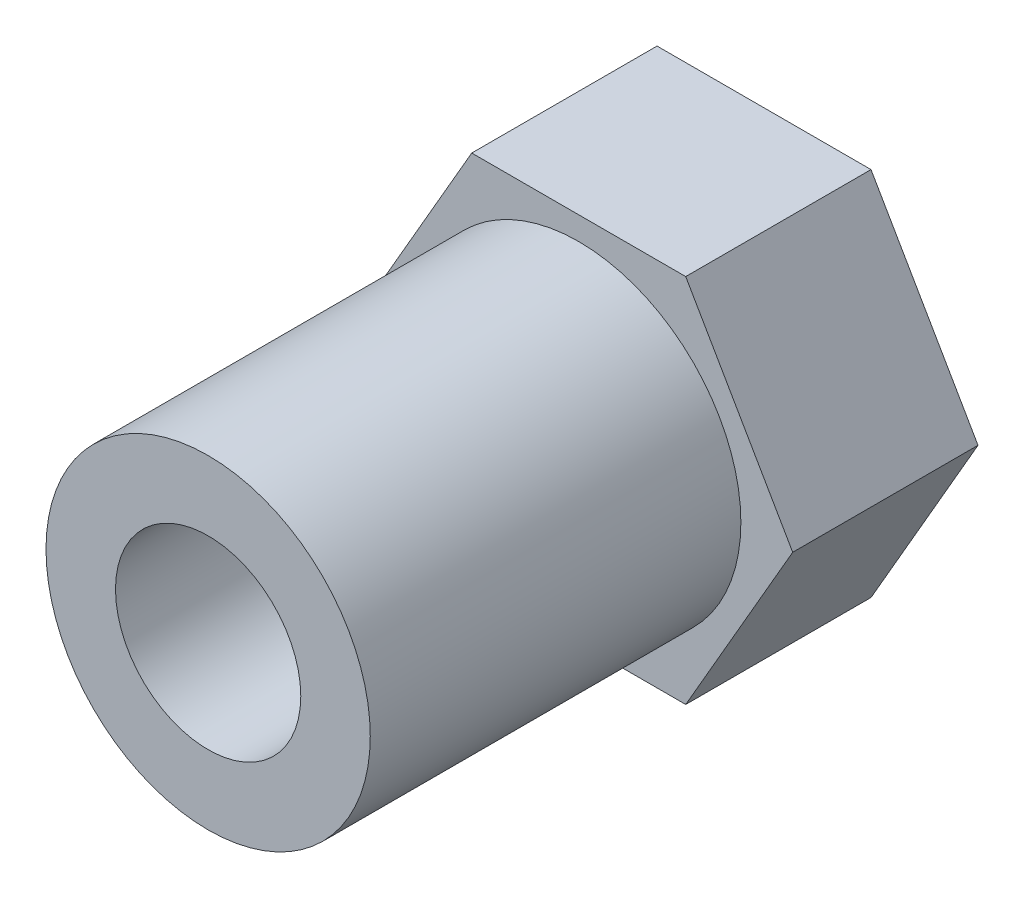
ISO-10303-21;
HEADER;
FILE_DESCRIPTION(('STEP AP214'),'2;1');
FILE_NAME('part.step','',(''),(''),'','','');
FILE_SCHEMA(('AUTOMOTIVE_DESIGN { 1 0 10303 214 1 1 1 1 }'));
ENDSEC;
DATA;
#1=APPLICATION_CONTEXT('core data for automotive mechanical design processes');
#2=APPLICATION_PROTOCOL_DEFINITION('international standard','automotive_design',2000,#1);
#3=PRODUCT_CONTEXT('',#1,'mechanical');
#4=PRODUCT('Part','Part','',(#3));
#5=PRODUCT_RELATED_PRODUCT_CATEGORY('part','',(#4));
#6=PRODUCT_DEFINITION_FORMATION('','',#4);
#7=PRODUCT_DEFINITION_CONTEXT('part definition',#1,'design');
#8=PRODUCT_DEFINITION('design','',#6,#7);
#9=PRODUCT_DEFINITION_SHAPE('','',#8);
#10=(LENGTH_UNIT() NAMED_UNIT(*) SI_UNIT(.MILLI.,.METRE.));
#11=(NAMED_UNIT(*) PLANE_ANGLE_UNIT() SI_UNIT($,.RADIAN.));
#12=(NAMED_UNIT(*) SI_UNIT($,.STERADIAN.) SOLID_ANGLE_UNIT());
#13=UNCERTAINTY_MEASURE_WITH_UNIT(LENGTH_MEASURE(1.E-05),#10,'distance_accuracy_value','');
#14=(GEOMETRIC_REPRESENTATION_CONTEXT(3) GLOBAL_UNCERTAINTY_ASSIGNED_CONTEXT((#13)) GLOBAL_UNIT_ASSIGNED_CONTEXT((#10,
#11,#12)) REPRESENTATION_CONTEXT('',''));
#15=CARTESIAN_POINT('',(0.,0.,0.));
#16=DIRECTION('',(0.,0.,1.));
#17=DIRECTION('',(1.,0.,0.));
#18=AXIS2_PLACEMENT_3D('',#15,#16,#17);
#19=CARTESIAN_POINT('',(3.46410161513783,-5.99999999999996,6.));
#20=DIRECTION('',(-0.866025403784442,0.499999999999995,0.));
#21=DIRECTION('',(-0.499999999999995,-0.866025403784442,0.));
#22=AXIS2_PLACEMENT_3D('',#19,#20,#21);
#23=PLANE('',#22);
#24=DIRECTION('',(0.499999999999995,0.866025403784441,0.));
#25=VECTOR('',#24,1.);
#26=CARTESIAN_POINT('',(3.46410161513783,-5.99999999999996,0.));
#27=LINE('',#26,#25);
#28=CARTESIAN_POINT('',(3.46410161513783,-5.99999999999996,0.));
#29=VERTEX_POINT('',#28);
#30=CARTESIAN_POINT('',(6.92820323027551,0.,0.));
#31=VERTEX_POINT('',#30);
#32=EDGE_CURVE('E121',#29,#31,#27,.T.);
#33=ORIENTED_EDGE('',*,*,#32,.T.);
#34=DIRECTION('',(0.,0.,-1.));
#35=VECTOR('',#34,1.);
#36=CARTESIAN_POINT('',(6.92820323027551,0.,6.));
#37=LINE('',#36,#35);
#38=CARTESIAN_POINT('',(6.92820323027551,0.,6.));
#39=VERTEX_POINT('',#38);
#40=EDGE_CURVE('E11',#39,#31,#37,.T.);
#41=ORIENTED_EDGE('',*,*,#40,.F.);
#42=DIRECTION('',(0.499999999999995,0.866025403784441,0.));
#43=VECTOR('',#42,1.);
#44=CARTESIAN_POINT('',(3.46410161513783,-5.99999999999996,6.));
#45=LINE('',#44,#43);
#46=CARTESIAN_POINT('',(3.46410161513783,-5.99999999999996,6.));
#47=VERTEX_POINT('',#46);
#48=EDGE_CURVE('E132',#47,#39,#45,.T.);
#49=ORIENTED_EDGE('',*,*,#48,.F.);
#50=DIRECTION('',(0.,0.,-1.));
#51=VECTOR('',#50,1.);
#52=CARTESIAN_POINT('',(3.46410161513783,-5.99999999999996,6.));
#53=LINE('',#52,#51);
#54=EDGE_CURVE('E117',#47,#29,#53,.T.);
#55=ORIENTED_EDGE('',*,*,#54,.T.);
#56=EDGE_LOOP('',(#33,#41,#49,#55));
#57=FACE_BOUND('',#56,.T.);
#58=ADVANCED_FACE('F37',(#57),#23,.F.);
#59=CARTESIAN_POINT('',(6.92820323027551,0.,6.));
#60=DIRECTION('',(-0.866025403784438,-0.500000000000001,0.));
#61=DIRECTION('',(0.500000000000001,-0.866025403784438,0.));
#62=AXIS2_PLACEMENT_3D('',#59,#60,#61);
#63=PLANE('',#62);
#64=DIRECTION('',(-0.500000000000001,0.866025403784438,0.));
#65=VECTOR('',#64,1.);
#66=CARTESIAN_POINT('',(6.92820323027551,0.,0.));
#67=LINE('',#66,#65);
#68=CARTESIAN_POINT('',(3.46410161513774,6.00000000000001,0.));
#69=VERTEX_POINT('',#68);
#70=EDGE_CURVE('E124',#31,#69,#67,.T.);
#71=ORIENTED_EDGE('',*,*,#70,.T.);
#72=DIRECTION('',(0.,0.,-1.));
#73=VECTOR('',#72,1.);
#74=CARTESIAN_POINT('',(3.46410161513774,6.00000000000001,6.));
#75=LINE('',#74,#73);
#76=CARTESIAN_POINT('',(3.46410161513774,6.00000000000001,6.));
#77=VERTEX_POINT('',#76);
#78=EDGE_CURVE('E45',#77,#69,#75,.T.);
#79=ORIENTED_EDGE('',*,*,#78,.F.);
#80=DIRECTION('',(-0.500000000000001,0.866025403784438,0.));
#81=VECTOR('',#80,1.);
#82=CARTESIAN_POINT('',(6.92820323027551,0.,6.));
#83=LINE('',#82,#81);
#84=EDGE_CURVE('E90',#39,#77,#83,.T.);
#85=ORIENTED_EDGE('',*,*,#84,.F.);
#86=ORIENTED_EDGE('',*,*,#40,.T.);
#87=EDGE_LOOP('',(#71,#79,#85,#86));
#88=FACE_BOUND('',#87,.T.);
#89=ADVANCED_FACE('F157',(#88),#63,.F.);
#90=CARTESIAN_POINT('',(3.46410161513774,6.00000000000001,6.));
#91=DIRECTION('',(0.,-1.,0.));
#92=DIRECTION('',(1.,0.,0.));
#93=AXIS2_PLACEMENT_3D('',#90,#91,#92);
#94=PLANE('',#93);
#95=DIRECTION('',(-1.,0.,0.));
#96=VECTOR('',#95,1.);
#97=CARTESIAN_POINT('',(3.46410161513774,6.00000000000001,0.));
#98=LINE('',#97,#96);
#99=CARTESIAN_POINT('',(-3.46410161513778,5.99999999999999,0.));
#100=VERTEX_POINT('',#99);
#101=EDGE_CURVE('E127',#69,#100,#98,.T.);
#102=ORIENTED_EDGE('',*,*,#101,.T.);
#103=DIRECTION('',(0.,0.,-1.));
#104=VECTOR('',#103,1.);
#105=CARTESIAN_POINT('',(-3.46410161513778,5.99999999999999,6.));
#106=LINE('',#105,#104);
#107=CARTESIAN_POINT('',(-3.46410161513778,5.99999999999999,6.));
#108=VERTEX_POINT('',#107);
#109=EDGE_CURVE('E112',#108,#100,#106,.T.);
#110=ORIENTED_EDGE('',*,*,#109,.F.);
#111=DIRECTION('',(-1.,0.,0.));
#112=VECTOR('',#111,1.);
#113=CARTESIAN_POINT('',(3.46410161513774,6.00000000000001,6.));
#114=LINE('',#113,#112);
#115=EDGE_CURVE('E103',#77,#108,#114,.T.);
#116=ORIENTED_EDGE('',*,*,#115,.F.);
#117=ORIENTED_EDGE('',*,*,#78,.T.);
#118=EDGE_LOOP('',(#102,#110,#116,#117));
#119=FACE_BOUND('',#118,.T.);
#120=ADVANCED_FACE('F138',(#119),#94,.F.);
#121=CARTESIAN_POINT('',(-3.46410161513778,5.99999999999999,6.));
#122=DIRECTION('',(0.866025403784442,-0.499999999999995,0.));
#123=DIRECTION('',(0.499999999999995,0.866025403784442,0.));
#124=AXIS2_PLACEMENT_3D('',#121,#122,#123);
#125=PLANE('',#124);
#126=DIRECTION('',(-0.499999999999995,-0.866025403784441,0.));
#127=VECTOR('',#126,1.);
#128=CARTESIAN_POINT('',(-3.46410161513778,5.99999999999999,0.));
#129=LINE('',#128,#127);
#130=CARTESIAN_POINT('',(-6.92820323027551,0.,0.));
#131=VERTEX_POINT('',#130);
#132=EDGE_CURVE('E111',#100,#131,#129,.T.);
#133=ORIENTED_EDGE('',*,*,#132,.T.);
#134=DIRECTION('',(0.,0.,-1.));
#135=VECTOR('',#134,1.);
#136=CARTESIAN_POINT('',(-6.92820323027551,0.,6.));
#137=LINE('',#136,#135);
#138=CARTESIAN_POINT('',(-6.92820323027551,0.,6.));
#139=VERTEX_POINT('',#138);
#140=EDGE_CURVE('E108',#139,#131,#137,.T.);
#141=ORIENTED_EDGE('',*,*,#140,.F.);
#142=DIRECTION('',(-0.499999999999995,-0.866025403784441,0.));
#143=VECTOR('',#142,1.);
#144=CARTESIAN_POINT('',(-3.46410161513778,5.99999999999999,6.));
#145=LINE('',#144,#143);
#146=EDGE_CURVE('E97',#108,#139,#145,.T.);
#147=ORIENTED_EDGE('',*,*,#146,.F.);
#148=ORIENTED_EDGE('',*,*,#109,.T.);
#149=EDGE_LOOP('',(#133,#141,#147,#148));
#150=FACE_BOUND('',#149,.T.);
#151=ADVANCED_FACE('F109',(#150),#125,.F.);
#152=CARTESIAN_POINT('',(-6.92820323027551,0.,6.));
#153=DIRECTION('',(0.866025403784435,0.500000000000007,0.));
#154=DIRECTION('',(-0.500000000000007,0.866025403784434,0.));
#155=AXIS2_PLACEMENT_3D('',#152,#153,#154);
#156=PLANE('',#155);
#157=DIRECTION('',(0.500000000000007,-0.866025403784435,0.));
#158=VECTOR('',#157,1.);
#159=CARTESIAN_POINT('',(-6.92820323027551,0.,0.));
#160=LINE('',#159,#158);
#161=CARTESIAN_POINT('',(-3.4641016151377,-6.00000000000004,0.));
#162=VERTEX_POINT('',#161);
#163=EDGE_CURVE('E76',#131,#162,#160,.T.);
#164=ORIENTED_EDGE('',*,*,#163,.T.);
#165=DIRECTION('',(0.,0.,-1.));
#166=VECTOR('',#165,1.);
#167=CARTESIAN_POINT('',(-3.4641016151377,-6.00000000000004,6.));
#168=LINE('',#167,#166);
#169=CARTESIAN_POINT('',(-3.4641016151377,-6.00000000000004,6.));
#170=VERTEX_POINT('',#169);
#171=EDGE_CURVE('E113',#170,#162,#168,.T.);
#172=ORIENTED_EDGE('',*,*,#171,.F.);
#173=DIRECTION('',(0.500000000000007,-0.866025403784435,0.));
#174=VECTOR('',#173,1.);
#175=CARTESIAN_POINT('',(-6.92820323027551,0.,6.));
#176=LINE('',#175,#174);
#177=EDGE_CURVE('E101',#139,#170,#176,.T.);
#178=ORIENTED_EDGE('',*,*,#177,.F.);
#179=ORIENTED_EDGE('',*,*,#140,.T.);
#180=EDGE_LOOP('',(#164,#172,#178,#179));
#181=FACE_BOUND('',#180,.T.);
#182=ADVANCED_FACE('F115',(#181),#156,.F.);
#183=CARTESIAN_POINT('',(-3.4641016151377,-6.00000000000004,6.));
#184=DIRECTION('',(0.,1.,0.));
#185=DIRECTION('',(-1.,0.,0.));
#186=AXIS2_PLACEMENT_3D('',#183,#184,#185);
#187=PLANE('',#186);
#188=DIRECTION('',(1.,0.,0.));
#189=VECTOR('',#188,1.);
#190=CARTESIAN_POINT('',(-3.4641016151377,-6.00000000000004,0.));
#191=LINE('',#190,#189);
#192=EDGE_CURVE('E82',#162,#29,#191,.T.);
#193=ORIENTED_EDGE('',*,*,#192,.T.);
#194=ORIENTED_EDGE('',*,*,#54,.F.);
#195=DIRECTION('',(1.,0.,0.));
#196=VECTOR('',#195,1.);
#197=CARTESIAN_POINT('',(-3.4641016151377,-6.00000000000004,6.));
#198=LINE('',#197,#196);
#199=EDGE_CURVE('E53',#170,#47,#198,.T.);
#200=ORIENTED_EDGE('',*,*,#199,.F.);
#201=ORIENTED_EDGE('',*,*,#171,.T.);
#202=EDGE_LOOP('',(#193,#194,#200,#201));
#203=FACE_BOUND('',#202,.T.);
#204=ADVANCED_FACE('F145',(#203),#187,.F.);
#205=CARTESIAN_POINT('',(0.,0.,6.));
#206=DIRECTION('',(0.,0.,1.));
#207=DIRECTION('',(1.,0.,0.));
#208=AXIS2_PLACEMENT_3D('',#205,#206,#207);
#209=PLANE('',#208);
#210=CARTESIAN_POINT('',(0.,0.,6.));
#211=DIRECTION('',(0.,0.,1.));
#212=DIRECTION('',(1.,0.,0.));
#213=AXIS2_PLACEMENT_3D('',#210,#211,#212);
#214=CIRCLE('',#213,5.25);
#215=CARTESIAN_POINT('',(5.25,0.,6.));
#216=VERTEX_POINT('',#215);
#217=EDGE_CURVE('E262',#216,#216,#214,.T.);
#218=ORIENTED_EDGE('',*,*,#217,.F.);
#219=EDGE_LOOP('',(#218));
#220=FACE_BOUND('',#219,.T.);
#221=ORIENTED_EDGE('',*,*,#48,.T.);
#222=ORIENTED_EDGE('',*,*,#84,.T.);
#223=ORIENTED_EDGE('',*,*,#115,.T.);
#224=ORIENTED_EDGE('',*,*,#146,.T.);
#225=ORIENTED_EDGE('',*,*,#177,.T.);
#226=ORIENTED_EDGE('',*,*,#199,.T.);
#227=EDGE_LOOP('',(#221,#222,#223,#224,#225,#226));
#228=FACE_BOUND('',#227,.T.);
#229=ADVANCED_FACE('F99',(#220,#228),#209,.T.);
#230=CARTESIAN_POINT('',(0.,0.,0.));
#231=DIRECTION('',(0.,0.,1.));
#232=DIRECTION('',(1.,0.,0.));
#233=AXIS2_PLACEMENT_3D('',#230,#231,#232);
#234=PLANE('',#233);
#235=CARTESIAN_POINT('',(0.,0.,0.));
#236=DIRECTION('',(0.,0.,1.));
#237=DIRECTION('',(1.,0.,0.));
#238=AXIS2_PLACEMENT_3D('',#235,#236,#237);
#239=CIRCLE('',#238,2.);
#240=CARTESIAN_POINT('',(2.,0.,0.));
#241=VERTEX_POINT('',#240);
#242=EDGE_CURVE('E253',#241,#241,#239,.T.);
#243=ORIENTED_EDGE('',*,*,#242,.T.);
#244=EDGE_LOOP('',(#243));
#245=FACE_BOUND('',#244,.T.);
#246=ORIENTED_EDGE('',*,*,#32,.F.);
#247=ORIENTED_EDGE('',*,*,#192,.F.);
#248=ORIENTED_EDGE('',*,*,#163,.F.);
#249=ORIENTED_EDGE('',*,*,#132,.F.);
#250=ORIENTED_EDGE('',*,*,#101,.F.);
#251=ORIENTED_EDGE('',*,*,#70,.F.);
#252=EDGE_LOOP('',(#246,#247,#248,#249,#250,#251));
#253=FACE_BOUND('',#252,.T.);
#254=ADVANCED_FACE('F141',(#245,#253),#234,.F.);
#255=CARTESIAN_POINT('',(0.,0.,18.));
#256=DIRECTION('',(0.,0.,-1.));
#257=DIRECTION('',(-1.,0.,0.));
#258=AXIS2_PLACEMENT_3D('',#255,#256,#257);
#259=CYLINDRICAL_SURFACE('',#258,5.25);
#260=CARTESIAN_POINT('',(0.,0.,18.));
#261=DIRECTION('',(0.,0.,1.));
#262=DIRECTION('',(1.,0.,0.));
#263=AXIS2_PLACEMENT_3D('',#260,#261,#262);
#264=CIRCLE('',#263,5.25);
#265=CARTESIAN_POINT('',(5.25,0.,18.));
#266=VERTEX_POINT('',#265);
#267=EDGE_CURVE('E125',#266,#266,#264,.T.);
#268=ORIENTED_EDGE('',*,*,#267,.F.);
#269=EDGE_LOOP('',(#268));
#270=FACE_BOUND('',#269,.T.);
#271=ORIENTED_EDGE('',*,*,#217,.T.);
#272=EDGE_LOOP('',(#271));
#273=FACE_BOUND('',#272,.T.);
#274=ADVANCED_FACE('F192',(#270,#273),#259,.T.);
#275=CARTESIAN_POINT('',(0.,0.,18.));
#276=DIRECTION('',(0.,0.,1.));
#277=DIRECTION('',(1.,0.,0.));
#278=AXIS2_PLACEMENT_3D('',#275,#276,#277);
#279=PLANE('',#278);
#280=CARTESIAN_POINT('',(0.,0.,18.));
#281=DIRECTION('',(0.,0.,1.));
#282=DIRECTION('',(1.,0.,0.));
#283=AXIS2_PLACEMENT_3D('',#280,#281,#282);
#284=CIRCLE('',#283,3.);
#285=CARTESIAN_POINT('',(3.,0.,18.));
#286=VERTEX_POINT('',#285);
#287=EDGE_CURVE('E254',#286,#286,#284,.T.);
#288=ORIENTED_EDGE('',*,*,#287,.F.);
#289=EDGE_LOOP('',(#288));
#290=FACE_BOUND('',#289,.T.);
#291=ORIENTED_EDGE('',*,*,#267,.T.);
#292=EDGE_LOOP('',(#291));
#293=FACE_BOUND('',#292,.T.);
#294=ADVANCED_FACE('F197',(#290,#293),#279,.T.);
#295=CARTESIAN_POINT('',(0.,0.,6.));
#296=DIRECTION('',(0.,0.,1.));
#297=DIRECTION('',(1.,0.,0.));
#298=AXIS2_PLACEMENT_3D('',#295,#296,#297);
#299=CYLINDRICAL_SURFACE('',#298,3.);
#300=CARTESIAN_POINT('',(0.,0.,6.));
#301=DIRECTION('',(0.,0.,1.));
#302=DIRECTION('',(1.,0.,0.));
#303=AXIS2_PLACEMENT_3D('',#300,#301,#302);
#304=CIRCLE('',#303,3.);
#305=CARTESIAN_POINT('',(3.,0.,6.));
#306=VERTEX_POINT('',#305);
#307=EDGE_CURVE('E257',#306,#306,#304,.T.);
#308=ORIENTED_EDGE('',*,*,#307,.F.);
#309=EDGE_LOOP('',(#308));
#310=FACE_BOUND('',#309,.T.);
#311=ORIENTED_EDGE('',*,*,#287,.T.);
#312=EDGE_LOOP('',(#311));
#313=FACE_BOUND('',#312,.T.);
#314=ADVANCED_FACE('F207',(#310,#313),#299,.F.);
#315=CARTESIAN_POINT('',(0.,0.,6.));
#316=DIRECTION('',(0.,0.,1.));
#317=DIRECTION('',(1.,0.,0.));
#318=AXIS2_PLACEMENT_3D('',#315,#316,#317);
#319=PLANE('',#318);
#320=CARTESIAN_POINT('',(0.,0.,6.));
#321=DIRECTION('',(0.,0.,1.));
#322=DIRECTION('',(1.,0.,0.));
#323=AXIS2_PLACEMENT_3D('',#320,#321,#322);
#324=CIRCLE('',#323,2.);
#325=CARTESIAN_POINT('',(2.,0.,6.));
#326=VERTEX_POINT('',#325);
#327=EDGE_CURVE('E250',#326,#326,#324,.T.);
#328=ORIENTED_EDGE('',*,*,#327,.F.);
#329=EDGE_LOOP('',(#328));
#330=FACE_BOUND('',#329,.T.);
#331=ORIENTED_EDGE('',*,*,#307,.T.);
#332=EDGE_LOOP('',(#331));
#333=FACE_BOUND('',#332,.T.);
#334=ADVANCED_FACE('F217',(#330,#333),#319,.T.);
#335=CARTESIAN_POINT('',(0.,0.,-4.));
#336=DIRECTION('',(0.,0.,1.));
#337=DIRECTION('',(1.,0.,0.));
#338=AXIS2_PLACEMENT_3D('',#335,#336,#337);
#339=CYLINDRICAL_SURFACE('',#338,2.);
#340=ORIENTED_EDGE('',*,*,#327,.T.);
#341=EDGE_LOOP('',(#340));
#342=FACE_BOUND('',#341,.T.);
#343=ORIENTED_EDGE('',*,*,#242,.F.);
#344=EDGE_LOOP('',(#343));
#345=FACE_BOUND('',#344,.T.);
#346=ADVANCED_FACE('F233',(#342,#345),#339,.F.);
#347=CLOSED_SHELL('',(#58,#89,#120,#151,#182,#204,#229,#254,#274,#294,#314,#334,#346));
#348=MANIFOLD_SOLID_BREP('B2',#347);
#349=ADVANCED_BREP_SHAPE_REPRESENTATION('',(#18,#348),#14);
#350=SHAPE_DEFINITION_REPRESENTATION(#9,#349);
ENDSEC;
END-ISO-10303-21;
